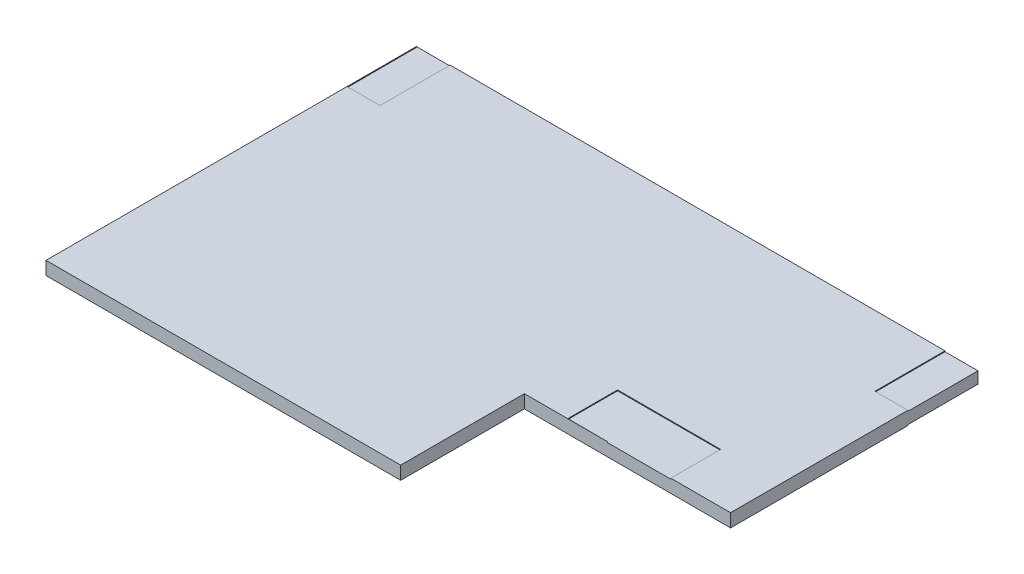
ISO-10303-21;
HEADER;
FILE_DESCRIPTION(('STEP AP214'),'2;1');
FILE_NAME('part.step','',(''),(''),'','','');
FILE_SCHEMA(('AUTOMOTIVE_DESIGN { 1 0 10303 214 1 1 1 1 }'));
ENDSEC;
DATA;
#1=APPLICATION_CONTEXT('core data for automotive mechanical design processes');
#2=APPLICATION_PROTOCOL_DEFINITION('international standard','automotive_design',2000,#1);
#3=PRODUCT_CONTEXT('',#1,'mechanical');
#4=PRODUCT('Part','Part','',(#3));
#5=PRODUCT_RELATED_PRODUCT_CATEGORY('part','',(#4));
#6=PRODUCT_DEFINITION_FORMATION('','',#4);
#7=PRODUCT_DEFINITION_CONTEXT('part definition',#1,'design');
#8=PRODUCT_DEFINITION('design','',#6,#7);
#9=PRODUCT_DEFINITION_SHAPE('','',#8);
#10=(LENGTH_UNIT() NAMED_UNIT(*) SI_UNIT(.MILLI.,.METRE.));
#11=(NAMED_UNIT(*) PLANE_ANGLE_UNIT() SI_UNIT($,.RADIAN.));
#12=(NAMED_UNIT(*) SI_UNIT($,.STERADIAN.) SOLID_ANGLE_UNIT());
#13=UNCERTAINTY_MEASURE_WITH_UNIT(LENGTH_MEASURE(1.E-05),#10,'distance_accuracy_value','');
#14=(GEOMETRIC_REPRESENTATION_CONTEXT(3) GLOBAL_UNCERTAINTY_ASSIGNED_CONTEXT((#13)) GLOBAL_UNIT_ASSIGNED_CONTEXT((#10,
#11,#12)) REPRESENTATION_CONTEXT('',''));
#15=CARTESIAN_POINT('',(0.,0.,0.));
#16=DIRECTION('',(0.,0.,1.));
#17=DIRECTION('',(1.,0.,0.));
#18=AXIS2_PLACEMENT_3D('',#15,#16,#17);
#19=CARTESIAN_POINT('',(23.0110952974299,72.4022939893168,45.));
#20=DIRECTION('',(0.,-1.,0.));
#21=DIRECTION('',(0.,0.,-1.));
#22=AXIS2_PLACEMENT_3D('',#19,#20,#21);
#23=PLANE('',#22);
#24=DIRECTION('',(-1.,0.,0.));
#25=VECTOR('',#24,1.);
#26=CARTESIAN_POINT('',(23.0110952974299,72.4022939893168,0.));
#27=LINE('',#26,#25);
#28=CARTESIAN_POINT('',(87.0110899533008,72.4022939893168,0.));
#29=VERTEX_POINT('',#28);
#30=CARTESIAN_POINT('',(27.0110899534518,72.4022939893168,0.));
#31=VERTEX_POINT('',#30);
#32=EDGE_CURVE('E343',#29,#31,#27,.T.);
#33=ORIENTED_EDGE('',*,*,#32,.T.);
#34=DIRECTION('',(0.,0.,-1.));
#35=VECTOR('',#34,1.);
#36=CARTESIAN_POINT('',(27.0110899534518,72.4022939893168,8.50000000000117));
#37=LINE('',#36,#35);
#38=CARTESIAN_POINT('',(27.0110899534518,72.4022939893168,8.50000000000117));
#39=VERTEX_POINT('',#38);
#40=EDGE_CURVE('E255',#39,#31,#37,.T.);
#41=ORIENTED_EDGE('',*,*,#40,.F.);
#42=DIRECTION('',(1.,0.,0.));
#43=VECTOR('',#42,1.);
#44=CARTESIAN_POINT('',(27.0110899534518,72.4022939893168,8.50000000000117));
#45=LINE('',#44,#43);
#46=CARTESIAN_POINT('',(23.0298114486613,72.4022939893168,8.50000000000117));
#47=VERTEX_POINT('',#46);
#48=EDGE_CURVE('E252',#47,#39,#45,.T.);
#49=ORIENTED_EDGE('',*,*,#48,.F.);
#50=DIRECTION('',(0.00220189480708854,0.,0.999997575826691));
#51=VECTOR('',#50,1.);
#52=CARTESIAN_POINT('',(23.0298114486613,72.4022939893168,8.50000000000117));
#53=LINE('',#52,#51);
#54=CARTESIAN_POINT('',(23.0110952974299,72.4022939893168,0.));
#55=VERTEX_POINT('',#54);
#56=EDGE_CURVE('E244',#55,#47,#53,.T.);
#57=ORIENTED_EDGE('',*,*,#56,.F.);
#58=DIRECTION('',(0.,0.,-1.));
#59=VECTOR('',#58,1.);
#60=CARTESIAN_POINT('',(23.0110952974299,72.4022939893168,45.));
#61=LINE('',#60,#59);
#62=CARTESIAN_POINT('',(23.0110952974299,72.4022939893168,45.));
#63=VERTEX_POINT('',#62);
#64=EDGE_CURVE('E369',#63,#55,#61,.T.);
#65=ORIENTED_EDGE('',*,*,#64,.F.);
#66=DIRECTION('',(-1.,0.,0.));
#67=VECTOR('',#66,1.);
#68=CARTESIAN_POINT('',(23.0110952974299,72.4022939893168,45.));
#69=LINE('',#68,#67);
#70=CARTESIAN_POINT('',(66.0110952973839,72.4022939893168,45.));
#71=VERTEX_POINT('',#70);
#72=EDGE_CURVE('E355',#71,#63,#69,.T.);
#73=ORIENTED_EDGE('',*,*,#72,.F.);
#74=DIRECTION('',(0.,0.,1.));
#75=VECTOR('',#74,1.);
#76=CARTESIAN_POINT('',(66.0110952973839,72.4022939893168,64.));
#77=LINE('',#76,#75);
#78=CARTESIAN_POINT('',(66.0110952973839,72.4022939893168,30.));
#79=VERTEX_POINT('',#78);
#80=EDGE_CURVE('E322',#79,#71,#77,.T.);
#81=ORIENTED_EDGE('',*,*,#80,.F.);
#82=DIRECTION('',(-1.,0.,0.));
#83=VECTOR('',#82,1.);
#84=CARTESIAN_POINT('',(91.0110952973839,72.4022939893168,30.));
#85=LINE('',#84,#83);
#86=CARTESIAN_POINT('',(76.1055324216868,72.4022939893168,30.));
#87=VERTEX_POINT('',#86);
#88=EDGE_CURVE('E328',#87,#79,#85,.T.);
#89=ORIENTED_EDGE('',*,*,#88,.F.);
#90=DIRECTION('',(0.99994203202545,0.,0.0107671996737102));
#91=VECTOR('',#90,1.);
#92=CARTESIAN_POINT('',(83.7610899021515,72.4022939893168,30.08243369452));
#93=LINE('',#92,#91);
#94=CARTESIAN_POINT('',(71.2610899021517,72.4022939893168,29.9478358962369));
#95=VERTEX_POINT('',#94);
#96=EDGE_CURVE('E272',#95,#87,#93,.T.);
#97=ORIENTED_EDGE('',*,*,#96,.F.);
#98=DIRECTION('',(0.,0.,1.));
#99=VECTOR('',#98,1.);
#100=CARTESIAN_POINT('',(71.2610899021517,72.4022939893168,29.9478358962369));
#101=LINE('',#100,#99);
#102=CARTESIAN_POINT('',(71.2610899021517,72.4022939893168,23.9526071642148));
#103=VERTEX_POINT('',#102);
#104=EDGE_CURVE('E282',#103,#95,#101,.T.);
#105=ORIENTED_EDGE('',*,*,#104,.F.);
#106=DIRECTION('',(-1.,0.,0.));
#107=VECTOR('',#106,1.);
#108=CARTESIAN_POINT('',(83.7610899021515,72.4022939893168,23.9526071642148));
#109=LINE('',#108,#107);
#110=CARTESIAN_POINT('',(83.7610899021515,72.4022939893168,23.9526071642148));
#111=VERTEX_POINT('',#110);
#112=EDGE_CURVE('E279',#111,#103,#109,.T.);
#113=ORIENTED_EDGE('',*,*,#112,.F.);
#114=DIRECTION('',(0.,0.,-1.));
#115=VECTOR('',#114,1.);
#116=CARTESIAN_POINT('',(83.7610899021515,72.4022939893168,30.08243369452));
#117=LINE('',#116,#115);
#118=CARTESIAN_POINT('',(83.7610899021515,72.4022939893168,30.));
#119=VERTEX_POINT('',#118);
#120=EDGE_CURVE('E277',#119,#111,#117,.T.);
#121=ORIENTED_EDGE('',*,*,#120,.F.);
#122=CARTESIAN_POINT('',(91.0110952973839,72.4022939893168,30.));
#123=VERTEX_POINT('',#122);
#124=EDGE_CURVE('E329',#123,#119,#85,.T.);
#125=ORIENTED_EDGE('',*,*,#124,.F.);
#126=DIRECTION('',(0.,0.,-1.));
#127=VECTOR('',#126,1.);
#128=CARTESIAN_POINT('',(91.0110952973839,72.4022939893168,45.));
#129=LINE('',#128,#127);
#130=CARTESIAN_POINT('',(91.0110952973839,72.4022939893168,8.50000000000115));
#131=VERTEX_POINT('',#130);
#132=EDGE_CURVE('E362',#123,#131,#129,.T.);
#133=ORIENTED_EDGE('',*,*,#132,.T.);
#134=DIRECTION('',(1.,0.,0.));
#135=VECTOR('',#134,1.);
#136=CARTESIAN_POINT('',(91.0110952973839,72.4022939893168,8.50000000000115));
#137=LINE('',#136,#135);
#138=CARTESIAN_POINT('',(87.0110899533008,72.4022939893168,8.50000000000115));
#139=VERTEX_POINT('',#138);
#140=EDGE_CURVE('E305',#139,#131,#137,.T.);
#141=ORIENTED_EDGE('',*,*,#140,.F.);
#142=DIRECTION('',(0.,0.,1.));
#143=VECTOR('',#142,1.);
#144=CARTESIAN_POINT('',(87.0110899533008,72.4022939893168,8.50000000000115));
#145=LINE('',#144,#143);
#146=EDGE_CURVE('E298',#29,#139,#145,.T.);
#147=ORIENTED_EDGE('',*,*,#146,.F.);
#148=EDGE_LOOP('',(#33,#41,#49,#57,#65,#73,#81,#89,#97,#105,#113,#121,#125,#133,#141,#147));
#149=FACE_BOUND('',#148,.T.);
#150=ADVANCED_FACE('F34',(#149),#23,.F.);
#151=CARTESIAN_POINT('',(23.0110952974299,70.8022939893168,45.));
#152=DIRECTION('',(1.,0.,0.));
#153=DIRECTION('',(0.,0.,-1.));
#154=AXIS2_PLACEMENT_3D('',#151,#152,#153);
#155=PLANE('',#154);
#156=DIRECTION('',(0.,-1.,0.));
#157=VECTOR('',#156,1.);
#158=CARTESIAN_POINT('',(23.0110952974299,70.8022939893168,0.));
#159=LINE('',#158,#157);
#160=CARTESIAN_POINT('',(23.0110952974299,72.3022939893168,0.));
#161=VERTEX_POINT('',#160);
#162=EDGE_CURVE('E347',#55,#161,#159,.T.);
#163=ORIENTED_EDGE('',*,*,#162,.T.);
#164=CARTESIAN_POINT('',(23.0110952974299,70.9022939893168,0.));
#165=VERTEX_POINT('',#164);
#166=EDGE_CURVE('E346',#161,#165,#159,.T.);
#167=ORIENTED_EDGE('',*,*,#166,.T.);
#168=DIRECTION('',(0.,-1.,0.));
#169=VECTOR('',#168,1.);
#170=CARTESIAN_POINT('',(23.0110952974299,70.9022939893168,0.));
#171=LINE('',#170,#169);
#172=CARTESIAN_POINT('',(23.0110952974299,70.8022939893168,0.));
#173=VERTEX_POINT('',#172);
#174=EDGE_CURVE('E241',#165,#173,#171,.T.);
#175=ORIENTED_EDGE('',*,*,#174,.T.);
#176=DIRECTION('',(0.,0.,-1.));
#177=VECTOR('',#176,1.);
#178=CARTESIAN_POINT('',(23.0110952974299,70.8022939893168,45.));
#179=LINE('',#178,#177);
#180=CARTESIAN_POINT('',(23.0110952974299,70.8022939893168,45.));
#181=VERTEX_POINT('',#180);
#182=EDGE_CURVE('E366',#181,#173,#179,.T.);
#183=ORIENTED_EDGE('',*,*,#182,.F.);
#184=DIRECTION('',(0.,-1.,0.));
#185=VECTOR('',#184,1.);
#186=CARTESIAN_POINT('',(23.0110952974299,70.8022939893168,45.));
#187=LINE('',#186,#185);
#188=EDGE_CURVE('E357',#63,#181,#187,.T.);
#189=ORIENTED_EDGE('',*,*,#188,.F.);
#190=ORIENTED_EDGE('',*,*,#64,.T.);
#191=EDGE_LOOP('',(#163,#167,#175,#183,#189,#190));
#192=FACE_BOUND('',#191,.T.);
#193=ADVANCED_FACE('F439',(#192),#155,.F.);
#194=CARTESIAN_POINT('',(23.0110952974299,70.8022939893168,45.));
#195=DIRECTION('',(0.,1.,0.));
#196=DIRECTION('',(0.,0.,1.));
#197=AXIS2_PLACEMENT_3D('',#194,#195,#196);
#198=PLANE('',#197);
#199=DIRECTION('',(1.,0.,0.));
#200=VECTOR('',#199,1.);
#201=CARTESIAN_POINT('',(23.0110952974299,70.8022939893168,0.));
#202=LINE('',#201,#200);
#203=CARTESIAN_POINT('',(27.0110899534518,70.8022939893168,0.));
#204=VERTEX_POINT('',#203);
#205=CARTESIAN_POINT('',(87.0110899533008,70.8022939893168,0.));
#206=VERTEX_POINT('',#205);
#207=EDGE_CURVE('E350',#204,#206,#202,.T.);
#208=ORIENTED_EDGE('',*,*,#207,.T.);
#209=DIRECTION('',(0.,0.,-1.));
#210=VECTOR('',#209,1.);
#211=CARTESIAN_POINT('',(87.0110899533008,70.8022939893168,8.50000000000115));
#212=LINE('',#211,#210);
#213=CARTESIAN_POINT('',(87.0110899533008,70.8022939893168,8.50000000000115));
#214=VERTEX_POINT('',#213);
#215=EDGE_CURVE('E211',#214,#206,#212,.T.);
#216=ORIENTED_EDGE('',*,*,#215,.F.);
#217=DIRECTION('',(-1.,0.,0.));
#218=VECTOR('',#217,1.);
#219=CARTESIAN_POINT('',(91.0110952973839,70.8022939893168,8.50000000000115));
#220=LINE('',#219,#218);
#221=CARTESIAN_POINT('',(91.0110952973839,70.8022939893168,8.50000000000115));
#222=VERTEX_POINT('',#221);
#223=EDGE_CURVE('E419',#222,#214,#220,.T.);
#224=ORIENTED_EDGE('',*,*,#223,.F.);
#225=DIRECTION('',(0.,0.,-1.));
#226=VECTOR('',#225,1.);
#227=CARTESIAN_POINT('',(91.0110952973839,70.8022939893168,45.));
#228=LINE('',#227,#226);
#229=CARTESIAN_POINT('',(91.0110952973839,70.8022939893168,30.));
#230=VERTEX_POINT('',#229);
#231=EDGE_CURVE('E217',#230,#222,#228,.T.);
#232=ORIENTED_EDGE('',*,*,#231,.F.);
#233=DIRECTION('',(-1.,0.,0.));
#234=VECTOR('',#233,1.);
#235=CARTESIAN_POINT('',(23.0110952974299,70.8022939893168,30.));
#236=LINE('',#235,#234);
#237=CARTESIAN_POINT('',(66.0110952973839,70.8022939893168,30.));
#238=VERTEX_POINT('',#237);
#239=EDGE_CURVE('E340',#230,#238,#236,.T.);
#240=ORIENTED_EDGE('',*,*,#239,.T.);
#241=DIRECTION('',(0.,0.,1.));
#242=VECTOR('',#241,1.);
#243=CARTESIAN_POINT('',(66.0110952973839,70.8022939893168,45.));
#244=LINE('',#243,#242);
#245=CARTESIAN_POINT('',(66.0110952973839,70.8022939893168,45.));
#246=VERTEX_POINT('',#245);
#247=EDGE_CURVE('E336',#238,#246,#244,.T.);
#248=ORIENTED_EDGE('',*,*,#247,.T.);
#249=DIRECTION('',(1.,0.,0.));
#250=VECTOR('',#249,1.);
#251=CARTESIAN_POINT('',(23.0110952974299,70.8022939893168,45.));
#252=LINE('',#251,#250);
#253=EDGE_CURVE('E359',#181,#246,#252,.T.);
#254=ORIENTED_EDGE('',*,*,#253,.F.);
#255=ORIENTED_EDGE('',*,*,#182,.T.);
#256=DIRECTION('',(-0.00220189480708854,0.,-0.999997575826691));
#257=VECTOR('',#256,1.);
#258=CARTESIAN_POINT('',(23.0298114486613,70.8022939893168,8.50000000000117));
#259=LINE('',#258,#257);
#260=CARTESIAN_POINT('',(23.0298114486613,70.8022939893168,8.50000000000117));
#261=VERTEX_POINT('',#260);
#262=EDGE_CURVE('E227',#261,#173,#259,.T.);
#263=ORIENTED_EDGE('',*,*,#262,.F.);
#264=DIRECTION('',(-1.,0.,0.));
#265=VECTOR('',#264,1.);
#266=CARTESIAN_POINT('',(27.0110899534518,70.8022939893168,8.50000000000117));
#267=LINE('',#266,#265);
#268=CARTESIAN_POINT('',(27.0110899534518,70.8022939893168,8.50000000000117));
#269=VERTEX_POINT('',#268);
#270=EDGE_CURVE('E237',#269,#261,#267,.T.);
#271=ORIENTED_EDGE('',*,*,#270,.F.);
#272=DIRECTION('',(0.,0.,1.));
#273=VECTOR('',#272,1.);
#274=CARTESIAN_POINT('',(27.0110899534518,70.8022939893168,8.50000000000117));
#275=LINE('',#274,#273);
#276=EDGE_CURVE('E234',#204,#269,#275,.T.);
#277=ORIENTED_EDGE('',*,*,#276,.F.);
#278=EDGE_LOOP('',(#208,#216,#224,#232,#240,#248,#254,#255,#263,#271,#277));
#279=FACE_BOUND('',#278,.T.);
#280=ADVANCED_FACE('F416',(#279),#198,.F.);
#281=CARTESIAN_POINT('',(91.0110952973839,70.8022939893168,45.));
#282=DIRECTION('',(-1.,0.,0.));
#283=DIRECTION('',(0.,0.,1.));
#284=AXIS2_PLACEMENT_3D('',#281,#282,#283);
#285=PLANE('',#284);
#286=ORIENTED_EDGE('',*,*,#231,.T.);
#287=DIRECTION('',(0.,-1.,0.));
#288=VECTOR('',#287,1.);
#289=CARTESIAN_POINT('',(91.0110952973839,70.9022939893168,8.50000000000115));
#290=LINE('',#289,#288);
#291=CARTESIAN_POINT('',(91.0110952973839,70.9022939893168,8.50000000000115));
#292=VERTEX_POINT('',#291);
#293=EDGE_CURVE('E200',#292,#222,#290,.T.);
#294=ORIENTED_EDGE('',*,*,#293,.F.);
#295=DIRECTION('',(0.,0.,1.));
#296=VECTOR('',#295,1.);
#297=CARTESIAN_POINT('',(91.0110952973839,70.9022939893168,0.));
#298=LINE('',#297,#296);
#299=CARTESIAN_POINT('',(91.0110952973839,70.9022939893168,0.));
#300=VERTEX_POINT('',#299);
#301=EDGE_CURVE('E203',#300,#292,#298,.T.);
#302=ORIENTED_EDGE('',*,*,#301,.F.);
#303=DIRECTION('',(0.,1.,0.));
#304=VECTOR('',#303,1.);
#305=CARTESIAN_POINT('',(91.0110952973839,70.8022939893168,0.));
#306=LINE('',#305,#304);
#307=CARTESIAN_POINT('',(91.0110952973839,72.3022939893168,0.));
#308=VERTEX_POINT('',#307);
#309=EDGE_CURVE('E353',#300,#308,#306,.T.);
#310=ORIENTED_EDGE('',*,*,#309,.T.);
#311=DIRECTION('',(0.,0.,-1.));
#312=VECTOR('',#311,1.);
#313=CARTESIAN_POINT('',(91.0110952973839,72.3022939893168,8.50000000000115));
#314=LINE('',#313,#312);
#315=CARTESIAN_POINT('',(91.0110952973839,72.3022939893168,8.50000000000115));
#316=VERTEX_POINT('',#315);
#317=EDGE_CURVE('E313',#316,#308,#314,.T.);
#318=ORIENTED_EDGE('',*,*,#317,.F.);
#319=DIRECTION('',(0.,1.,0.));
#320=VECTOR('',#319,1.);
#321=CARTESIAN_POINT('',(91.0110952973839,72.3022939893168,8.50000000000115));
#322=LINE('',#321,#320);
#323=EDGE_CURVE('E323',#316,#131,#322,.T.);
#324=ORIENTED_EDGE('',*,*,#323,.T.);
#325=ORIENTED_EDGE('',*,*,#132,.F.);
#326=DIRECTION('',(0.,1.,0.));
#327=VECTOR('',#326,1.);
#328=CARTESIAN_POINT('',(91.0110952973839,70.4022939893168,30.));
#329=LINE('',#328,#327);
#330=EDGE_CURVE('E332',#230,#123,#329,.T.);
#331=ORIENTED_EDGE('',*,*,#330,.F.);
#332=EDGE_LOOP('',(#286,#294,#302,#310,#318,#324,#325,#331));
#333=FACE_BOUND('',#332,.T.);
#334=ADVANCED_FACE('F214',(#333),#285,.F.);
#335=CARTESIAN_POINT('',(91.0110952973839,72.4022939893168,45.));
#336=DIRECTION('',(0.,0.,1.));
#337=DIRECTION('',(1.,0.,0.));
#338=AXIS2_PLACEMENT_3D('',#335,#336,#337);
#339=PLANE('',#338);
#340=DIRECTION('',(0.,-1.,0.));
#341=VECTOR('',#340,1.);
#342=CARTESIAN_POINT('',(66.0110952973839,72.4022939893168,45.));
#343=LINE('',#342,#341);
#344=EDGE_CURVE('E372',#71,#246,#343,.T.);
#345=ORIENTED_EDGE('',*,*,#344,.F.);
#346=ORIENTED_EDGE('',*,*,#72,.T.);
#347=ORIENTED_EDGE('',*,*,#188,.T.);
#348=ORIENTED_EDGE('',*,*,#253,.T.);
#349=EDGE_LOOP('',(#345,#346,#347,#348));
#350=FACE_BOUND('',#349,.T.);
#351=ADVANCED_FACE('F411',(#350),#339,.T.);
#352=CARTESIAN_POINT('',(91.0110952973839,72.4022939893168,0.));
#353=DIRECTION('',(0.,0.,1.));
#354=DIRECTION('',(1.,0.,0.));
#355=AXIS2_PLACEMENT_3D('',#352,#353,#354);
#356=PLANE('',#355);
#357=DIRECTION('',(1.,0.,0.));
#358=VECTOR('',#357,1.);
#359=CARTESIAN_POINT('',(87.0110899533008,70.9022939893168,0.));
#360=LINE('',#359,#358);
#361=CARTESIAN_POINT('',(87.0110899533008,70.9022939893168,0.));
#362=VERTEX_POINT('',#361);
#363=EDGE_CURVE('E208',#362,#300,#360,.T.);
#364=ORIENTED_EDGE('',*,*,#363,.F.);
#365=DIRECTION('',(0.,-1.,0.));
#366=VECTOR('',#365,1.);
#367=CARTESIAN_POINT('',(87.0110899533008,70.9022939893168,0.));
#368=LINE('',#367,#366);
#369=EDGE_CURVE('E219',#362,#206,#368,.T.);
#370=ORIENTED_EDGE('',*,*,#369,.T.);
#371=ORIENTED_EDGE('',*,*,#207,.F.);
#372=DIRECTION('',(0.,-1.,0.));
#373=VECTOR('',#372,1.);
#374=CARTESIAN_POINT('',(27.0110899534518,70.9022939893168,0.));
#375=LINE('',#374,#373);
#376=CARTESIAN_POINT('',(27.0110899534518,70.9022939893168,0.));
#377=VERTEX_POINT('',#376);
#378=EDGE_CURVE('E233',#377,#204,#375,.T.);
#379=ORIENTED_EDGE('',*,*,#378,.F.);
#380=DIRECTION('',(1.,0.,0.));
#381=VECTOR('',#380,1.);
#382=CARTESIAN_POINT('',(23.0110952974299,70.9022939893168,0.));
#383=LINE('',#382,#381);
#384=EDGE_CURVE('E224',#165,#377,#383,.T.);
#385=ORIENTED_EDGE('',*,*,#384,.F.);
#386=ORIENTED_EDGE('',*,*,#166,.F.);
#387=DIRECTION('',(-1.,0.,0.));
#388=VECTOR('',#387,1.);
#389=CARTESIAN_POINT('',(23.0110952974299,72.3022939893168,0.));
#390=LINE('',#389,#388);
#391=CARTESIAN_POINT('',(27.0110899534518,72.3022939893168,0.));
#392=VERTEX_POINT('',#391);
#393=EDGE_CURVE('E257',#392,#161,#390,.T.);
#394=ORIENTED_EDGE('',*,*,#393,.F.);
#395=DIRECTION('',(0.,1.,0.));
#396=VECTOR('',#395,1.);
#397=CARTESIAN_POINT('',(27.0110899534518,72.3022939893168,0.));
#398=LINE('',#397,#396);
#399=EDGE_CURVE('E269',#392,#31,#398,.T.);
#400=ORIENTED_EDGE('',*,*,#399,.T.);
#401=ORIENTED_EDGE('',*,*,#32,.F.);
#402=DIRECTION('',(0.,1.,0.));
#403=VECTOR('',#402,1.);
#404=CARTESIAN_POINT('',(87.0110899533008,72.3022939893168,0.));
#405=LINE('',#404,#403);
#406=CARTESIAN_POINT('',(87.0110899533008,72.3022939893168,0.));
#407=VERTEX_POINT('',#406);
#408=EDGE_CURVE('E320',#407,#29,#405,.T.);
#409=ORIENTED_EDGE('',*,*,#408,.F.);
#410=DIRECTION('',(-1.,0.,0.));
#411=VECTOR('',#410,1.);
#412=CARTESIAN_POINT('',(91.0110952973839,72.3022939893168,0.));
#413=LINE('',#412,#411);
#414=EDGE_CURVE('E316',#308,#407,#413,.T.);
#415=ORIENTED_EDGE('',*,*,#414,.F.);
#416=ORIENTED_EDGE('',*,*,#309,.F.);
#417=EDGE_LOOP('',(#364,#370,#371,#379,#385,#386,#394,#400,#401,#409,#415,#416));
#418=FACE_BOUND('',#417,.T.);
#419=ADVANCED_FACE('F426',(#418),#356,.F.);
#420=CARTESIAN_POINT('',(91.0110952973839,70.4022939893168,30.));
#421=DIRECTION('',(0.,0.,-1.));
#422=DIRECTION('',(-1.,0.,0.));
#423=AXIS2_PLACEMENT_3D('',#420,#421,#422);
#424=PLANE('',#423);
#425=DIRECTION('',(-1.,0.,0.));
#426=VECTOR('',#425,1.);
#427=CARTESIAN_POINT('',(91.0110952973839,72.3022939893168,30.));
#428=LINE('',#427,#426);
#429=CARTESIAN_POINT('',(83.7610899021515,72.3022939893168,30.));
#430=VERTEX_POINT('',#429);
#431=CARTESIAN_POINT('',(76.1055324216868,72.3022939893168,30.));
#432=VERTEX_POINT('',#431);
#433=EDGE_CURVE('E374',#430,#432,#428,.T.);
#434=ORIENTED_EDGE('',*,*,#433,.T.);
#435=DIRECTION('',(0.,1.,0.));
#436=VECTOR('',#435,1.);
#437=CARTESIAN_POINT('',(76.1055324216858,70.4022939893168,30.));
#438=LINE('',#437,#436);
#439=EDGE_CURVE('E11',#432,#87,#438,.T.);
#440=ORIENTED_EDGE('',*,*,#439,.T.);
#441=ORIENTED_EDGE('',*,*,#88,.T.);
#442=DIRECTION('',(0.,1.,0.));
#443=VECTOR('',#442,1.);
#444=CARTESIAN_POINT('',(66.0110952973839,70.4022939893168,30.));
#445=LINE('',#444,#443);
#446=EDGE_CURVE('E333',#238,#79,#445,.T.);
#447=ORIENTED_EDGE('',*,*,#446,.F.);
#448=ORIENTED_EDGE('',*,*,#239,.F.);
#449=ORIENTED_EDGE('',*,*,#330,.T.);
#450=ORIENTED_EDGE('',*,*,#124,.T.);
#451=DIRECTION('',(0.,-1.,0.));
#452=VECTOR('',#451,1.);
#453=CARTESIAN_POINT('',(83.7610899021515,70.4022939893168,30.));
#454=LINE('',#453,#452);
#455=EDGE_CURVE('E41',#119,#430,#454,.T.);
#456=ORIENTED_EDGE('',*,*,#455,.T.);
#457=EDGE_LOOP('',(#434,#440,#441,#447,#448,#449,#450,#456));
#458=FACE_BOUND('',#457,.T.);
#459=ADVANCED_FACE('F378',(#458),#424,.F.);
#460=CARTESIAN_POINT('',(66.0110952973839,70.4022939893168,64.));
#461=DIRECTION('',(-1.,0.,0.));
#462=DIRECTION('',(0.,0.,1.));
#463=AXIS2_PLACEMENT_3D('',#460,#461,#462);
#464=PLANE('',#463);
#465=ORIENTED_EDGE('',*,*,#446,.T.);
#466=ORIENTED_EDGE('',*,*,#80,.T.);
#467=ORIENTED_EDGE('',*,*,#344,.T.);
#468=ORIENTED_EDGE('',*,*,#247,.F.);
#469=EDGE_LOOP('',(#465,#466,#467,#468));
#470=FACE_BOUND('',#469,.T.);
#471=ADVANCED_FACE('F409',(#470),#464,.F.);
#472=CARTESIAN_POINT('',(87.0110899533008,72.3022939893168,8.50000000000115));
#473=DIRECTION('',(-1.,0.,0.));
#474=DIRECTION('',(0.,-1.,0.));
#475=AXIS2_PLACEMENT_3D('',#472,#473,#474);
#476=PLANE('',#475);
#477=ORIENTED_EDGE('',*,*,#146,.T.);
#478=DIRECTION('',(0.,1.,0.));
#479=VECTOR('',#478,1.);
#480=CARTESIAN_POINT('',(87.0110899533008,72.3022939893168,8.50000000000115));
#481=LINE('',#480,#479);
#482=CARTESIAN_POINT('',(87.0110899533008,72.3022939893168,8.50000000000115));
#483=VERTEX_POINT('',#482);
#484=EDGE_CURVE('E319',#483,#139,#481,.T.);
#485=ORIENTED_EDGE('',*,*,#484,.F.);
#486=DIRECTION('',(0.,0.,1.));
#487=VECTOR('',#486,1.);
#488=CARTESIAN_POINT('',(87.0110899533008,72.3022939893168,8.50000000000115));
#489=LINE('',#488,#487);
#490=EDGE_CURVE('E307',#407,#483,#489,.T.);
#491=ORIENTED_EDGE('',*,*,#490,.F.);
#492=ORIENTED_EDGE('',*,*,#408,.T.);
#493=EDGE_LOOP('',(#477,#485,#491,#492));
#494=FACE_BOUND('',#493,.T.);
#495=ADVANCED_FACE('F458',(#494),#476,.F.);
#496=CARTESIAN_POINT('',(91.0110952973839,72.3022939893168,8.50000000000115));
#497=DIRECTION('',(0.,0.,1.));
#498=DIRECTION('',(0.,-1.,0.));
#499=AXIS2_PLACEMENT_3D('',#496,#497,#498);
#500=PLANE('',#499);
#501=ORIENTED_EDGE('',*,*,#140,.T.);
#502=ORIENTED_EDGE('',*,*,#323,.F.);
#503=DIRECTION('',(1.,0.,0.));
#504=VECTOR('',#503,1.);
#505=CARTESIAN_POINT('',(91.0110952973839,72.3022939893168,8.50000000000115));
#506=LINE('',#505,#504);
#507=EDGE_CURVE('E310',#483,#316,#506,.T.);
#508=ORIENTED_EDGE('',*,*,#507,.F.);
#509=ORIENTED_EDGE('',*,*,#484,.T.);
#510=EDGE_LOOP('',(#501,#502,#508,#509));
#511=FACE_BOUND('',#510,.T.);
#512=ADVANCED_FACE('F465',(#511),#500,.F.);
#513=CARTESIAN_POINT('',(87.0110899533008,72.3022939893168,8.50000000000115));
#514=DIRECTION('',(0.,1.,0.));
#515=DIRECTION('',(0.,0.,1.));
#516=AXIS2_PLACEMENT_3D('',#513,#514,#515);
#517=PLANE('',#516);
#518=ORIENTED_EDGE('',*,*,#490,.T.);
#519=ORIENTED_EDGE('',*,*,#507,.T.);
#520=ORIENTED_EDGE('',*,*,#317,.T.);
#521=ORIENTED_EDGE('',*,*,#414,.T.);
#522=EDGE_LOOP('',(#518,#519,#520,#521));
#523=FACE_BOUND('',#522,.T.);
#524=ADVANCED_FACE('F462',(#523),#517,.T.);
#525=CARTESIAN_POINT('',(83.7610899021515,72.3022939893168,30.08243369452));
#526=DIRECTION('',(-0.0107671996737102,0.,0.99994203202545));
#527=DIRECTION('',(0.99994203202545,0.,0.0107671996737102));
#528=AXIS2_PLACEMENT_3D('',#525,#526,#527);
#529=PLANE('',#528);
#530=DIRECTION('',(0.99994203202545,0.,0.0107671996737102));
#531=VECTOR('',#530,1.);
#532=CARTESIAN_POINT('',(83.7610899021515,72.3022939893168,30.08243369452));
#533=LINE('',#532,#531);
#534=CARTESIAN_POINT('',(71.2610899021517,72.3022939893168,29.9478358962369));
#535=VERTEX_POINT('',#534);
#536=EDGE_CURVE('E285',#535,#432,#533,.T.);
#537=ORIENTED_EDGE('',*,*,#536,.F.);
#538=DIRECTION('',(0.,1.,0.));
#539=VECTOR('',#538,1.);
#540=CARTESIAN_POINT('',(71.2610899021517,72.3022939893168,29.9478358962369));
#541=LINE('',#540,#539);
#542=EDGE_CURVE('E296',#535,#95,#541,.T.);
#543=ORIENTED_EDGE('',*,*,#542,.T.);
#544=ORIENTED_EDGE('',*,*,#96,.T.);
#545=ORIENTED_EDGE('',*,*,#439,.F.);
#546=EDGE_LOOP('',(#537,#543,#544,#545));
#547=FACE_BOUND('',#546,.T.);
#548=ADVANCED_FACE('F401',(#547),#529,.F.);
#549=CARTESIAN_POINT('',(83.7610899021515,72.3022939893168,30.08243369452));
#550=DIRECTION('',(1.,0.,0.));
#551=DIRECTION('',(0.,1.,0.));
#552=AXIS2_PLACEMENT_3D('',#549,#550,#551);
#553=PLANE('',#552);
#554=ORIENTED_EDGE('',*,*,#120,.T.);
#555=DIRECTION('',(0.,1.,0.));
#556=VECTOR('',#555,1.);
#557=CARTESIAN_POINT('',(83.7610899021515,72.3022939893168,23.9526071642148));
#558=LINE('',#557,#556);
#559=CARTESIAN_POINT('',(83.7610899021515,72.3022939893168,23.9526071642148));
#560=VERTEX_POINT('',#559);
#561=EDGE_CURVE('E295',#560,#111,#558,.T.);
#562=ORIENTED_EDGE('',*,*,#561,.F.);
#563=DIRECTION('',(0.,0.,-1.));
#564=VECTOR('',#563,1.);
#565=CARTESIAN_POINT('',(83.7610899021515,72.3022939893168,30.08243369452));
#566=LINE('',#565,#564);
#567=EDGE_CURVE('E287',#430,#560,#566,.T.);
#568=ORIENTED_EDGE('',*,*,#567,.F.);
#569=ORIENTED_EDGE('',*,*,#455,.F.);
#570=EDGE_LOOP('',(#554,#562,#568,#569));
#571=FACE_BOUND('',#570,.T.);
#572=ADVANCED_FACE('F383',(#571),#553,.F.);
#573=CARTESIAN_POINT('',(71.2610899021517,72.3022939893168,29.9478358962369));
#574=DIRECTION('',(0.,-1.,0.));
#575=DIRECTION('',(0.,0.,-1.));
#576=AXIS2_PLACEMENT_3D('',#573,#574,#575);
#577=PLANE('',#576);
#578=ORIENTED_EDGE('',*,*,#567,.T.);
#579=DIRECTION('',(-1.,0.,0.));
#580=VECTOR('',#579,1.);
#581=CARTESIAN_POINT('',(83.7610899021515,72.3022939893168,23.9526071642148));
#582=LINE('',#581,#580);
#583=CARTESIAN_POINT('',(71.2610899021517,72.3022939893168,23.9526071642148));
#584=VERTEX_POINT('',#583);
#585=EDGE_CURVE('E289',#560,#584,#582,.T.);
#586=ORIENTED_EDGE('',*,*,#585,.T.);
#587=DIRECTION('',(0.,0.,1.));
#588=VECTOR('',#587,1.);
#589=CARTESIAN_POINT('',(71.2610899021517,72.3022939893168,29.9478358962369));
#590=LINE('',#589,#588);
#591=EDGE_CURVE('E292',#584,#535,#590,.T.);
#592=ORIENTED_EDGE('',*,*,#591,.T.);
#593=ORIENTED_EDGE('',*,*,#536,.T.);
#594=ORIENTED_EDGE('',*,*,#433,.F.);
#595=EDGE_LOOP('',(#578,#586,#592,#593,#594));
#596=FACE_BOUND('',#595,.T.);
#597=ADVANCED_FACE('F395',(#596),#577,.F.);
#598=CARTESIAN_POINT('',(71.2610899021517,72.3022939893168,29.9478358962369));
#599=DIRECTION('',(-1.,0.,0.));
#600=DIRECTION('',(0.,-1.,0.));
#601=AXIS2_PLACEMENT_3D('',#598,#599,#600);
#602=PLANE('',#601);
#603=ORIENTED_EDGE('',*,*,#104,.T.);
#604=ORIENTED_EDGE('',*,*,#542,.F.);
#605=ORIENTED_EDGE('',*,*,#591,.F.);
#606=DIRECTION('',(0.,1.,0.));
#607=VECTOR('',#606,1.);
#608=CARTESIAN_POINT('',(71.2610899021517,72.3022939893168,23.9526071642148));
#609=LINE('',#608,#607);
#610=EDGE_CURVE('E299',#584,#103,#609,.T.);
#611=ORIENTED_EDGE('',*,*,#610,.T.);
#612=EDGE_LOOP('',(#603,#604,#605,#611));
#613=FACE_BOUND('',#612,.T.);
#614=ADVANCED_FACE('F397',(#613),#602,.F.);
#615=CARTESIAN_POINT('',(83.7610899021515,72.3022939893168,23.9526071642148));
#616=DIRECTION('',(0.,0.,-1.));
#617=DIRECTION('',(0.,1.,0.));
#618=AXIS2_PLACEMENT_3D('',#615,#616,#617);
#619=PLANE('',#618);
#620=ORIENTED_EDGE('',*,*,#112,.T.);
#621=ORIENTED_EDGE('',*,*,#610,.F.);
#622=ORIENTED_EDGE('',*,*,#585,.F.);
#623=ORIENTED_EDGE('',*,*,#561,.T.);
#624=EDGE_LOOP('',(#620,#621,#622,#623));
#625=FACE_BOUND('',#624,.T.);
#626=ADVANCED_FACE('F391',(#625),#619,.F.);
#627=CARTESIAN_POINT('',(27.0110899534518,72.3022939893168,8.50000000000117));
#628=DIRECTION('',(1.,0.,0.));
#629=DIRECTION('',(0.,1.,0.));
#630=AXIS2_PLACEMENT_3D('',#627,#628,#629);
#631=PLANE('',#630);
#632=ORIENTED_EDGE('',*,*,#40,.T.);
#633=ORIENTED_EDGE('',*,*,#399,.F.);
#634=DIRECTION('',(0.,0.,-1.));
#635=VECTOR('',#634,1.);
#636=CARTESIAN_POINT('',(27.0110899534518,72.3022939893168,8.50000000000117));
#637=LINE('',#636,#635);
#638=CARTESIAN_POINT('',(27.0110899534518,72.3022939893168,8.50000000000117));
#639=VERTEX_POINT('',#638);
#640=EDGE_CURVE('E266',#639,#392,#637,.T.);
#641=ORIENTED_EDGE('',*,*,#640,.F.);
#642=DIRECTION('',(0.,1.,0.));
#643=VECTOR('',#642,1.);
#644=CARTESIAN_POINT('',(27.0110899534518,72.3022939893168,8.50000000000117));
#645=LINE('',#644,#643);
#646=EDGE_CURVE('E273',#639,#39,#645,.T.);
#647=ORIENTED_EDGE('',*,*,#646,.T.);
#648=EDGE_LOOP('',(#632,#633,#641,#647));
#649=FACE_BOUND('',#648,.T.);
#650=ADVANCED_FACE('F556',(#649),#631,.F.);
#651=CARTESIAN_POINT('',(27.0110899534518,72.3022939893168,8.50000000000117));
#652=DIRECTION('',(0.,0.,1.));
#653=DIRECTION('',(0.,-1.,0.));
#654=AXIS2_PLACEMENT_3D('',#651,#652,#653);
#655=PLANE('',#654);
#656=ORIENTED_EDGE('',*,*,#48,.T.);
#657=ORIENTED_EDGE('',*,*,#646,.F.);
#658=DIRECTION('',(1.,0.,0.));
#659=VECTOR('',#658,1.);
#660=CARTESIAN_POINT('',(27.0110899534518,72.3022939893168,8.50000000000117));
#661=LINE('',#660,#659);
#662=CARTESIAN_POINT('',(23.0298114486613,72.3022939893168,8.50000000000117));
#663=VERTEX_POINT('',#662);
#664=EDGE_CURVE('E263',#663,#639,#661,.T.);
#665=ORIENTED_EDGE('',*,*,#664,.F.);
#666=DIRECTION('',(0.,1.,0.));
#667=VECTOR('',#666,1.);
#668=CARTESIAN_POINT('',(23.0298114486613,72.3022939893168,8.50000000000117));
#669=LINE('',#668,#667);
#670=EDGE_CURVE('E268',#663,#47,#669,.T.);
#671=ORIENTED_EDGE('',*,*,#670,.T.);
#672=EDGE_LOOP('',(#656,#657,#665,#671));
#673=FACE_BOUND('',#672,.T.);
#674=ADVANCED_FACE('F446',(#673),#655,.F.);
#675=CARTESIAN_POINT('',(23.0298114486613,72.3022939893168,8.50000000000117));
#676=DIRECTION('',(-0.999997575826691,0.,0.00220189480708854));
#677=DIRECTION('',(0.00220189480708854,0.,0.999997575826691));
#678=AXIS2_PLACEMENT_3D('',#675,#676,#677);
#679=PLANE('',#678);
#680=ORIENTED_EDGE('',*,*,#56,.T.);
#681=ORIENTED_EDGE('',*,*,#670,.F.);
#682=DIRECTION('',(0.00220189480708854,0.,0.999997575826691));
#683=VECTOR('',#682,1.);
#684=CARTESIAN_POINT('',(23.0298114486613,72.3022939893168,8.50000000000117));
#685=LINE('',#684,#683);
#686=EDGE_CURVE('E260',#161,#663,#685,.T.);
#687=ORIENTED_EDGE('',*,*,#686,.F.);
#688=ORIENTED_EDGE('',*,*,#162,.F.);
#689=EDGE_LOOP('',(#680,#681,#687,#688));
#690=FACE_BOUND('',#689,.T.);
#691=ADVANCED_FACE('F442',(#690),#679,.F.);
#692=CARTESIAN_POINT('',(27.0110899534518,72.3022939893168,0.));
#693=DIRECTION('',(0.,1.,0.));
#694=DIRECTION('',(0.,0.,1.));
#695=AXIS2_PLACEMENT_3D('',#692,#693,#694);
#696=PLANE('',#695);
#697=ORIENTED_EDGE('',*,*,#393,.T.);
#698=ORIENTED_EDGE('',*,*,#686,.T.);
#699=ORIENTED_EDGE('',*,*,#664,.T.);
#700=ORIENTED_EDGE('',*,*,#640,.T.);
#701=EDGE_LOOP('',(#697,#698,#699,#700));
#702=FACE_BOUND('',#701,.T.);
#703=ADVANCED_FACE('F450',(#702),#696,.T.);
#704=CARTESIAN_POINT('',(23.0298114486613,70.9022939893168,8.50000000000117));
#705=DIRECTION('',(-0.999997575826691,0.,0.00220189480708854));
#706=DIRECTION('',(0.00220189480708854,0.,0.999997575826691));
#707=AXIS2_PLACEMENT_3D('',#704,#705,#706);
#708=PLANE('',#707);
#709=ORIENTED_EDGE('',*,*,#262,.T.);
#710=ORIENTED_EDGE('',*,*,#174,.F.);
#711=DIRECTION('',(-0.00220189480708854,0.,-0.999997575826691));
#712=VECTOR('',#711,1.);
#713=CARTESIAN_POINT('',(23.0298114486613,70.9022939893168,8.50000000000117));
#714=LINE('',#713,#712);
#715=CARTESIAN_POINT('',(23.0298114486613,70.9022939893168,8.50000000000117));
#716=VERTEX_POINT('',#715);
#717=EDGE_CURVE('E56',#716,#165,#714,.T.);
#718=ORIENTED_EDGE('',*,*,#717,.F.);
#719=DIRECTION('',(0.,-1.,0.));
#720=VECTOR('',#719,1.);
#721=CARTESIAN_POINT('',(23.0298114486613,70.9022939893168,8.50000000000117));
#722=LINE('',#721,#720);
#723=EDGE_CURVE('E245',#716,#261,#722,.T.);
#724=ORIENTED_EDGE('',*,*,#723,.T.);
#725=EDGE_LOOP('',(#709,#710,#718,#724));
#726=FACE_BOUND('',#725,.T.);
#727=ADVANCED_FACE('F588',(#726),#708,.F.);
#728=CARTESIAN_POINT('',(27.0110899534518,70.9022939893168,8.50000000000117));
#729=DIRECTION('',(0.,0.,1.));
#730=DIRECTION('',(1.,0.,0.));
#731=AXIS2_PLACEMENT_3D('',#728,#729,#730);
#732=PLANE('',#731);
#733=ORIENTED_EDGE('',*,*,#270,.T.);
#734=ORIENTED_EDGE('',*,*,#723,.F.);
#735=DIRECTION('',(-1.,0.,0.));
#736=VECTOR('',#735,1.);
#737=CARTESIAN_POINT('',(27.0110899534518,70.9022939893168,8.50000000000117));
#738=LINE('',#737,#736);
#739=CARTESIAN_POINT('',(27.0110899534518,70.9022939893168,8.50000000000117));
#740=VERTEX_POINT('',#739);
#741=EDGE_CURVE('E230',#740,#716,#738,.T.);
#742=ORIENTED_EDGE('',*,*,#741,.F.);
#743=DIRECTION('',(0.,-1.,0.));
#744=VECTOR('',#743,1.);
#745=CARTESIAN_POINT('',(27.0110899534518,70.9022939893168,8.50000000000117));
#746=LINE('',#745,#744);
#747=EDGE_CURVE('E247',#740,#269,#746,.T.);
#748=ORIENTED_EDGE('',*,*,#747,.T.);
#749=EDGE_LOOP('',(#733,#734,#742,#748));
#750=FACE_BOUND('',#749,.T.);
#751=ADVANCED_FACE('F620',(#750),#732,.F.);
#752=CARTESIAN_POINT('',(27.0110899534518,70.9022939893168,8.50000000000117));
#753=DIRECTION('',(1.,0.,0.));
#754=DIRECTION('',(0.,0.,-1.));
#755=AXIS2_PLACEMENT_3D('',#752,#753,#754);
#756=PLANE('',#755);
#757=ORIENTED_EDGE('',*,*,#276,.T.);
#758=ORIENTED_EDGE('',*,*,#747,.F.);
#759=DIRECTION('',(0.,0.,1.));
#760=VECTOR('',#759,1.);
#761=CARTESIAN_POINT('',(27.0110899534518,70.9022939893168,8.50000000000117));
#762=LINE('',#761,#760);
#763=EDGE_CURVE('E226',#377,#740,#762,.T.);
#764=ORIENTED_EDGE('',*,*,#763,.F.);
#765=ORIENTED_EDGE('',*,*,#378,.T.);
#766=EDGE_LOOP('',(#757,#758,#764,#765));
#767=FACE_BOUND('',#766,.T.);
#768=ADVANCED_FACE('F432',(#767),#756,.F.);
#769=CARTESIAN_POINT('',(27.0110899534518,70.9022939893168,0.));
#770=DIRECTION('',(0.,1.,0.));
#771=DIRECTION('',(0.,0.,1.));
#772=AXIS2_PLACEMENT_3D('',#769,#770,#771);
#773=PLANE('',#772);
#774=ORIENTED_EDGE('',*,*,#384,.T.);
#775=ORIENTED_EDGE('',*,*,#763,.T.);
#776=ORIENTED_EDGE('',*,*,#741,.T.);
#777=ORIENTED_EDGE('',*,*,#717,.T.);
#778=EDGE_LOOP('',(#774,#775,#776,#777));
#779=FACE_BOUND('',#778,.T.);
#780=ADVANCED_FACE('F639',(#779),#773,.F.);
#781=CARTESIAN_POINT('',(87.0110899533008,70.9022939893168,8.50000000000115));
#782=DIRECTION('',(-1.,0.,0.));
#783=DIRECTION('',(0.,0.,1.));
#784=AXIS2_PLACEMENT_3D('',#781,#782,#783);
#785=PLANE('',#784);
#786=ORIENTED_EDGE('',*,*,#215,.T.);
#787=ORIENTED_EDGE('',*,*,#369,.F.);
#788=DIRECTION('',(0.,0.,-1.));
#789=VECTOR('',#788,1.);
#790=CARTESIAN_POINT('',(87.0110899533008,70.9022939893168,8.50000000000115));
#791=LINE('',#790,#789);
#792=CARTESIAN_POINT('',(87.0110899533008,70.9022939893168,8.50000000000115));
#793=VERTEX_POINT('',#792);
#794=EDGE_CURVE('E48',#793,#362,#791,.T.);
#795=ORIENTED_EDGE('',*,*,#794,.F.);
#796=DIRECTION('',(0.,-1.,0.));
#797=VECTOR('',#796,1.);
#798=CARTESIAN_POINT('',(87.0110899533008,70.9022939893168,8.50000000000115));
#799=LINE('',#798,#797);
#800=EDGE_CURVE('E202',#793,#214,#799,.T.);
#801=ORIENTED_EDGE('',*,*,#800,.T.);
#802=EDGE_LOOP('',(#786,#787,#795,#801));
#803=FACE_BOUND('',#802,.T.);
#804=ADVANCED_FACE('F648',(#803),#785,.F.);
#805=CARTESIAN_POINT('',(91.0110952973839,70.9022939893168,8.50000000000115));
#806=DIRECTION('',(0.,0.,1.));
#807=DIRECTION('',(1.,0.,0.));
#808=AXIS2_PLACEMENT_3D('',#805,#806,#807);
#809=PLANE('',#808);
#810=ORIENTED_EDGE('',*,*,#223,.T.);
#811=ORIENTED_EDGE('',*,*,#800,.F.);
#812=DIRECTION('',(-1.,0.,0.));
#813=VECTOR('',#812,1.);
#814=CARTESIAN_POINT('',(91.0110952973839,70.9022939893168,8.50000000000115));
#815=LINE('',#814,#813);
#816=EDGE_CURVE('E195',#292,#793,#815,.T.);
#817=ORIENTED_EDGE('',*,*,#816,.F.);
#818=ORIENTED_EDGE('',*,*,#293,.T.);
#819=EDGE_LOOP('',(#810,#811,#817,#818));
#820=FACE_BOUND('',#819,.T.);
#821=ADVANCED_FACE('F198',(#820),#809,.F.);
#822=CARTESIAN_POINT('',(91.0110952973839,70.9022939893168,0.));
#823=DIRECTION('',(0.,1.,0.));
#824=DIRECTION('',(0.,0.,1.));
#825=AXIS2_PLACEMENT_3D('',#822,#823,#824);
#826=PLANE('',#825);
#827=ORIENTED_EDGE('',*,*,#301,.T.);
#828=ORIENTED_EDGE('',*,*,#816,.T.);
#829=ORIENTED_EDGE('',*,*,#794,.T.);
#830=ORIENTED_EDGE('',*,*,#363,.T.);
#831=EDGE_LOOP('',(#827,#828,#829,#830));
#832=FACE_BOUND('',#831,.T.);
#833=ADVANCED_FACE('F206',(#832),#826,.F.);
#834=CLOSED_SHELL('',(#150,#193,#280,#334,#351,#419,#459,#471,#495,#512,#524,#548,#572,#597,
#614,#626,#650,#674,#691,#703,#727,#751,#768,#780,#804,#821,#833));
#835=MANIFOLD_SOLID_BREP('B2',#834);
#836=ADVANCED_BREP_SHAPE_REPRESENTATION('',(#18,#835),#14);
#837=SHAPE_DEFINITION_REPRESENTATION(#9,#836);
ENDSEC;
END-ISO-10303-21;
